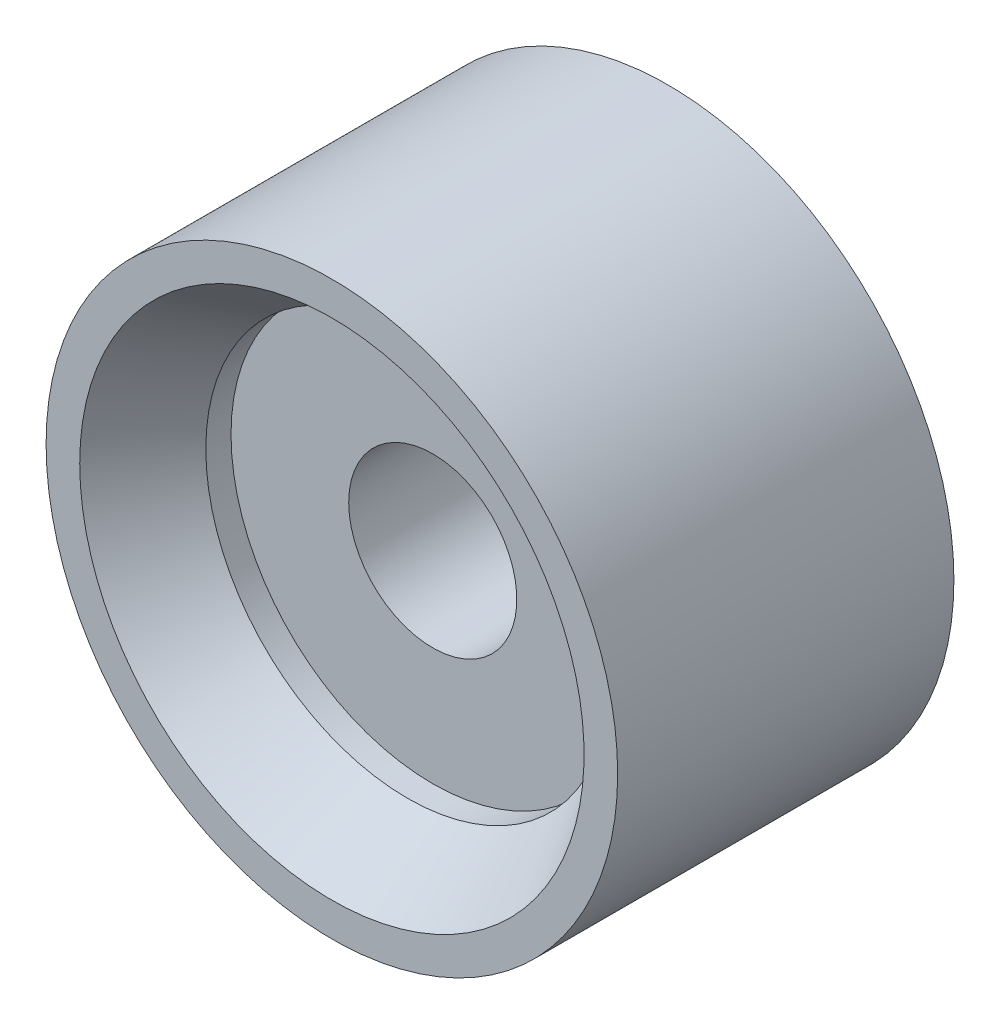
ISO-10303-21;
HEADER;
FILE_DESCRIPTION(('STEP AP214'),'2;1');
FILE_NAME('part.step','',(''),(''),'','','');
FILE_SCHEMA(('AUTOMOTIVE_DESIGN { 1 0 10303 214 1 1 1 1 }'));
ENDSEC;
DATA;
#1=APPLICATION_CONTEXT('core data for automotive mechanical design processes');
#2=APPLICATION_PROTOCOL_DEFINITION('international standard','automotive_design',2000,#1);
#3=PRODUCT_CONTEXT('',#1,'mechanical');
#4=PRODUCT('Part','Part','',(#3));
#5=PRODUCT_RELATED_PRODUCT_CATEGORY('part','',(#4));
#6=PRODUCT_DEFINITION_FORMATION('','',#4);
#7=PRODUCT_DEFINITION_CONTEXT('part definition',#1,'design');
#8=PRODUCT_DEFINITION('design','',#6,#7);
#9=PRODUCT_DEFINITION_SHAPE('','',#8);
#10=(LENGTH_UNIT() NAMED_UNIT(*) SI_UNIT(.MILLI.,.METRE.));
#11=(NAMED_UNIT(*) PLANE_ANGLE_UNIT() SI_UNIT($,.RADIAN.));
#12=(NAMED_UNIT(*) SI_UNIT($,.STERADIAN.) SOLID_ANGLE_UNIT());
#13=UNCERTAINTY_MEASURE_WITH_UNIT(LENGTH_MEASURE(1.E-05),#10,'distance_accuracy_value','');
#14=(GEOMETRIC_REPRESENTATION_CONTEXT(3) GLOBAL_UNCERTAINTY_ASSIGNED_CONTEXT((#13)) GLOBAL_UNIT_ASSIGNED_CONTEXT((#10,
#11,#12)) REPRESENTATION_CONTEXT('',''));
#15=CARTESIAN_POINT('',(0.,0.,0.));
#16=DIRECTION('',(0.,0.,1.));
#17=DIRECTION('',(1.,0.,0.));
#18=AXIS2_PLACEMENT_3D('',#15,#16,#17);
#19=CARTESIAN_POINT('',(0.,20.,10.));
#20=DIRECTION('',(0.,0.,1.));
#21=DIRECTION('',(1.,0.,0.));
#22=AXIS2_PLACEMENT_3D('',#19,#20,#21);
#23=PLANE('',#22);
#24=CARTESIAN_POINT('',(0.,0.,10.));
#25=DIRECTION('',(0.,0.,-1.));
#26=DIRECTION('',(-1.,0.,0.));
#27=AXIS2_PLACEMENT_3D('',#24,#25,#26);
#28=CIRCLE('',#27,15.);
#29=CARTESIAN_POINT('',(-15.,0.,10.));
#30=VERTEX_POINT('',#29);
#31=EDGE_CURVE('E32',#30,#30,#28,.T.);
#32=ORIENTED_EDGE('',*,*,#31,.T.);
#33=EDGE_LOOP('',(#32));
#34=FACE_BOUND('',#33,.T.);
#35=CARTESIAN_POINT('',(0.,0.,10.));
#36=DIRECTION('',(0.,0.,1.));
#37=DIRECTION('',(1.,0.,0.));
#38=AXIS2_PLACEMENT_3D('',#35,#36,#37);
#39=CIRCLE('',#38,17.);
#40=CARTESIAN_POINT('',(17.,0.,10.));
#41=VERTEX_POINT('',#40);
#42=EDGE_CURVE('E45',#41,#41,#39,.T.);
#43=ORIENTED_EDGE('',*,*,#42,.T.);
#44=EDGE_LOOP('',(#43));
#45=FACE_BOUND('',#44,.T.);
#46=ADVANCED_FACE('F12',(#34,#45),#23,.T.);
#47=CARTESIAN_POINT('',(0.,20.,-10.));
#48=DIRECTION('',(0.,0.,1.));
#49=DIRECTION('',(1.,0.,0.));
#50=AXIS2_PLACEMENT_3D('',#47,#48,#49);
#51=PLANE('',#50);
#52=CARTESIAN_POINT('',(0.,0.,-10.));
#53=DIRECTION('',(0.,0.,-1.));
#54=DIRECTION('',(-1.,0.,0.));
#55=AXIS2_PLACEMENT_3D('',#52,#53,#54);
#56=CIRCLE('',#55,15.);
#57=CARTESIAN_POINT('',(-15.,0.,-10.));
#58=VERTEX_POINT('',#57);
#59=EDGE_CURVE('E35',#58,#58,#56,.T.);
#60=ORIENTED_EDGE('',*,*,#59,.F.);
#61=EDGE_LOOP('',(#60));
#62=FACE_BOUND('',#61,.T.);
#63=CARTESIAN_POINT('',(0.,0.,-10.));
#64=DIRECTION('',(0.,0.,1.));
#65=DIRECTION('',(1.,0.,0.));
#66=AXIS2_PLACEMENT_3D('',#63,#64,#65);
#67=CIRCLE('',#66,17.);
#68=CARTESIAN_POINT('',(17.,0.,-10.));
#69=VERTEX_POINT('',#68);
#70=EDGE_CURVE('E44',#69,#69,#67,.T.);
#71=ORIENTED_EDGE('',*,*,#70,.F.);
#72=EDGE_LOOP('',(#71));
#73=FACE_BOUND('',#72,.T.);
#74=ADVANCED_FACE('F54',(#62,#73),#51,.F.);
#75=CARTESIAN_POINT('',(0.,5.,-4.));
#76=DIRECTION('',(0.,0.,-1.));
#77=DIRECTION('',(-1.,0.,0.));
#78=AXIS2_PLACEMENT_3D('',#75,#76,#77);
#79=PLANE('',#78);
#80=CARTESIAN_POINT('',(0.,0.,-4.));
#81=DIRECTION('',(0.,0.,-1.));
#82=DIRECTION('',(-1.,0.,0.));
#83=AXIS2_PLACEMENT_3D('',#80,#81,#82);
#84=CIRCLE('',#83,12.);
#85=CARTESIAN_POINT('',(-12.,0.,-4.));
#86=VERTEX_POINT('',#85);
#87=EDGE_CURVE('E41',#86,#86,#84,.T.);
#88=ORIENTED_EDGE('',*,*,#87,.T.);
#89=EDGE_LOOP('',(#88));
#90=FACE_BOUND('',#89,.T.);
#91=CARTESIAN_POINT('',(0.,0.,-4.));
#92=DIRECTION('',(0.,0.,-1.));
#93=DIRECTION('',(-1.,0.,0.));
#94=AXIS2_PLACEMENT_3D('',#91,#92,#93);
#95=CIRCLE('',#94,5.);
#96=CARTESIAN_POINT('',(-5.,0.,-4.));
#97=VERTEX_POINT('',#96);
#98=EDGE_CURVE('E8',#97,#97,#95,.T.);
#99=ORIENTED_EDGE('',*,*,#98,.F.);
#100=EDGE_LOOP('',(#99));
#101=FACE_BOUND('',#100,.T.);
#102=ADVANCED_FACE('F14',(#90,#101),#79,.T.);
#103=CARTESIAN_POINT('',(0.,0.,-20.));
#104=DIRECTION('',(0.,0.,-1.));
#105=DIRECTION('',(-1.,0.,0.));
#106=AXIS2_PLACEMENT_3D('',#103,#104,#105);
#107=CYLINDRICAL_SURFACE('',#106,5.);
#108=ORIENTED_EDGE('',*,*,#98,.T.);
#109=EDGE_LOOP('',(#108));
#110=FACE_BOUND('',#109,.T.);
#111=CARTESIAN_POINT('',(0.,0.,4.));
#112=DIRECTION('',(0.,0.,-1.));
#113=DIRECTION('',(-1.,0.,0.));
#114=AXIS2_PLACEMENT_3D('',#111,#112,#113);
#115=CIRCLE('',#114,5.);
#116=CARTESIAN_POINT('',(-5.,0.,4.));
#117=VERTEX_POINT('',#116);
#118=EDGE_CURVE('E19',#117,#117,#115,.T.);
#119=ORIENTED_EDGE('',*,*,#118,.F.);
#120=EDGE_LOOP('',(#119));
#121=FACE_BOUND('',#120,.T.);
#122=ADVANCED_FACE('F64',(#110,#121),#107,.F.);
#123=CARTESIAN_POINT('',(0.,5.,4.));
#124=DIRECTION('',(0.,0.,-1.));
#125=DIRECTION('',(-1.,0.,0.));
#126=AXIS2_PLACEMENT_3D('',#123,#124,#125);
#127=PLANE('',#126);
#128=CARTESIAN_POINT('',(0.,0.,4.));
#129=DIRECTION('',(0.,0.,-1.));
#130=DIRECTION('',(-1.,0.,0.));
#131=AXIS2_PLACEMENT_3D('',#128,#129,#130);
#132=CIRCLE('',#131,12.);
#133=CARTESIAN_POINT('',(-12.,0.,4.));
#134=VERTEX_POINT('',#133);
#135=EDGE_CURVE('E23',#134,#134,#132,.T.);
#136=ORIENTED_EDGE('',*,*,#135,.F.);
#137=EDGE_LOOP('',(#136));
#138=FACE_BOUND('',#137,.T.);
#139=ORIENTED_EDGE('',*,*,#118,.T.);
#140=EDGE_LOOP('',(#139));
#141=FACE_BOUND('',#140,.T.);
#142=ADVANCED_FACE('F80',(#138,#141),#127,.F.);
#143=CARTESIAN_POINT('',(0.,0.,-20.));
#144=DIRECTION('',(0.,0.,-1.));
#145=DIRECTION('',(-1.,0.,0.));
#146=AXIS2_PLACEMENT_3D('',#143,#144,#145);
#147=CYLINDRICAL_SURFACE('',#146,12.);
#148=CARTESIAN_POINT('',(0.,0.,5.5));
#149=DIRECTION('',(0.,0.,-1.));
#150=DIRECTION('',(-1.,0.,0.));
#151=AXIS2_PLACEMENT_3D('',#148,#149,#150);
#152=CIRCLE('',#151,12.);
#153=CARTESIAN_POINT('',(-12.,0.,5.5));
#154=VERTEX_POINT('',#153);
#155=EDGE_CURVE('E27',#154,#154,#152,.T.);
#156=ORIENTED_EDGE('',*,*,#155,.F.);
#157=EDGE_LOOP('',(#156));
#158=FACE_BOUND('',#157,.T.);
#159=ORIENTED_EDGE('',*,*,#135,.T.);
#160=EDGE_LOOP('',(#159));
#161=FACE_BOUND('',#160,.T.);
#162=ADVANCED_FACE('F76',(#158,#161),#147,.F.);
#163=CARTESIAN_POINT('',(0.,0.,5.5));
#164=DIRECTION('',(0.,0.,1.));
#165=DIRECTION('',(1.,0.,0.));
#166=AXIS2_PLACEMENT_3D('',#163,#164,#165);
#167=CONICAL_SURFACE('',#166,12.,0.588002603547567);
#168=ORIENTED_EDGE('',*,*,#31,.F.);
#169=EDGE_LOOP('',(#168));
#170=FACE_BOUND('',#169,.T.);
#171=ORIENTED_EDGE('',*,*,#155,.T.);
#172=EDGE_LOOP('',(#171));
#173=FACE_BOUND('',#172,.T.);
#174=ADVANCED_FACE('F73',(#170,#173),#167,.F.);
#175=CARTESIAN_POINT('',(0.,0.,-5.5));
#176=DIRECTION('',(0.,0.,-1.));
#177=DIRECTION('',(-1.,0.,0.));
#178=AXIS2_PLACEMENT_3D('',#175,#176,#177);
#179=CONICAL_SURFACE('',#178,12.,0.588002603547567);
#180=ORIENTED_EDGE('',*,*,#59,.T.);
#181=EDGE_LOOP('',(#180));
#182=FACE_BOUND('',#181,.T.);
#183=CARTESIAN_POINT('',(0.,0.,-5.5));
#184=DIRECTION('',(0.,0.,-1.));
#185=DIRECTION('',(-1.,0.,0.));
#186=AXIS2_PLACEMENT_3D('',#183,#184,#185);
#187=CIRCLE('',#186,12.);
#188=CARTESIAN_POINT('',(-12.,0.,-5.5));
#189=VERTEX_POINT('',#188);
#190=EDGE_CURVE('E38',#189,#189,#187,.T.);
#191=ORIENTED_EDGE('',*,*,#190,.F.);
#192=EDGE_LOOP('',(#191));
#193=FACE_BOUND('',#192,.T.);
#194=ADVANCED_FACE('F70',(#182,#193),#179,.F.);
#195=CARTESIAN_POINT('',(0.,0.,-20.));
#196=DIRECTION('',(0.,0.,-1.));
#197=DIRECTION('',(-1.,0.,0.));
#198=AXIS2_PLACEMENT_3D('',#195,#196,#197);
#199=CYLINDRICAL_SURFACE('',#198,12.);
#200=ORIENTED_EDGE('',*,*,#190,.T.);
#201=EDGE_LOOP('',(#200));
#202=FACE_BOUND('',#201,.T.);
#203=ORIENTED_EDGE('',*,*,#87,.F.);
#204=EDGE_LOOP('',(#203));
#205=FACE_BOUND('',#204,.T.);
#206=ADVANCED_FACE('F118',(#202,#205),#199,.F.);
#207=CARTESIAN_POINT('',(0.,0.,-10.));
#208=DIRECTION('',(0.,0.,1.));
#209=DIRECTION('',(1.,0.,0.));
#210=AXIS2_PLACEMENT_3D('',#207,#208,#209);
#211=CYLINDRICAL_SURFACE('',#210,17.);
#212=ORIENTED_EDGE('',*,*,#70,.T.);
#213=EDGE_LOOP('',(#212));
#214=FACE_BOUND('',#213,.T.);
#215=ORIENTED_EDGE('',*,*,#42,.F.);
#216=EDGE_LOOP('',(#215));
#217=FACE_BOUND('',#216,.T.);
#218=ADVANCED_FACE('F51',(#214,#217),#211,.T.);
#219=CLOSED_SHELL('',(#46,#74,#102,#122,#142,#162,#174,#194,#206,#218));
#220=MANIFOLD_SOLID_BREP('B1',#219);
#221=ADVANCED_BREP_SHAPE_REPRESENTATION('',(#18,#220),#14);
#222=SHAPE_DEFINITION_REPRESENTATION(#9,#221);
ENDSEC;
END-ISO-10303-21;
